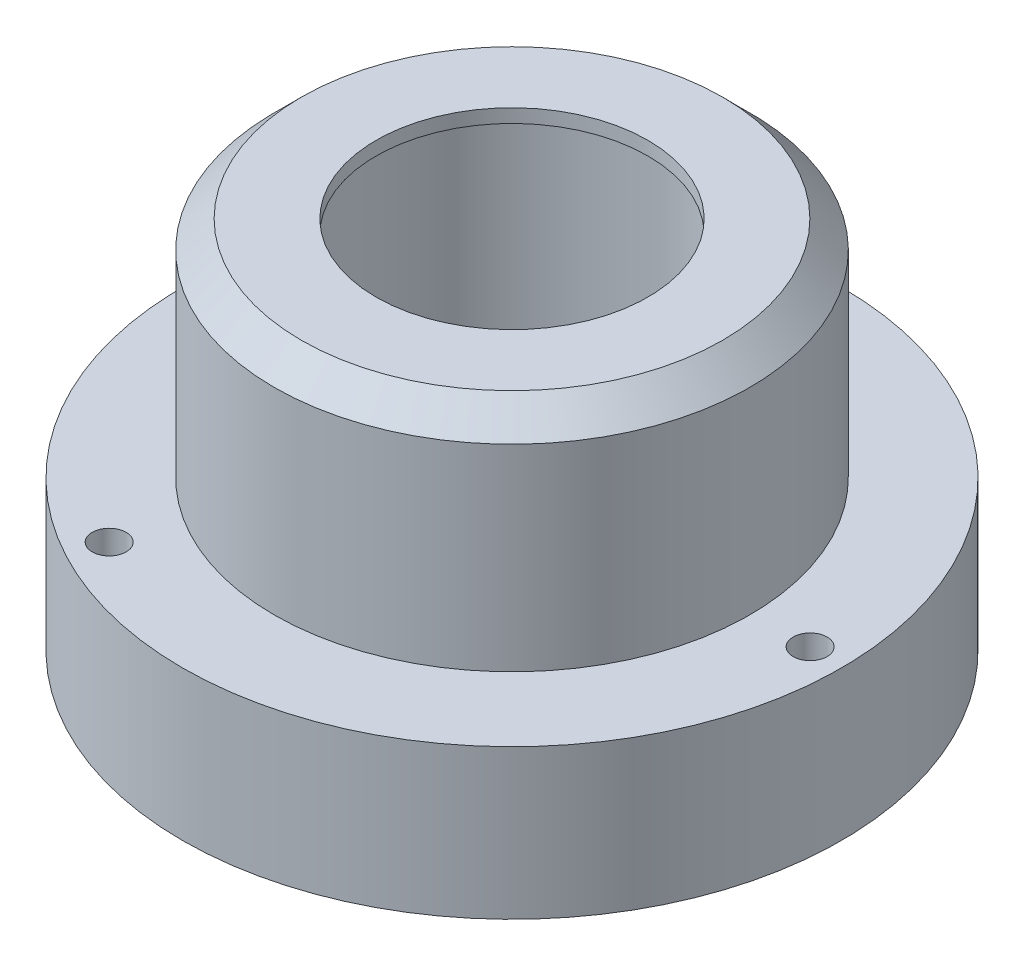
from build123d import *

# Parameters (mm, degrees)
R_P_TITION_CIRCULAIRE1_COUNT = 3


with BuildPart() as part:
    # Esquisse1 → R_volution1 (revolve)
    with BuildSketch(Plane.XY, mode=Mode.PRIVATE) as r_volution1_sk:
        Polygon((23.5, 0), (23.5, 53), (20, 53), (20, 55), (31, 55), (35, 51), (35, 22), (48.5, 22), (48.5, 0), align=None)
    revolve(r_volution1_sk.sketch.rotate(Axis((0, 45.247444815, 0), (0, -1, 0)), 90), axis=Axis((0, 45.247444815, 0), (0, -1, 0)))

    # Esquisse2 → Trou taraud_ M61 (revolve, cut)
    with BuildSketch(Plane(origin=(43.498358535, 22, -0.377895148), x_dir=(0, 0, 1), z_dir=(1, 0, 0))):
        Polygon((0, 0), (0, 18.443375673), (2.5, 17), (2.5, 0), align=None)
    trou_taraud_m61 = revolve(axis=Axis((43.498358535, 28.35, -0.377895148), (0, -1, 0)), mode=Mode.SUBTRACT)

    # Esquisse3 → Trou taraud_ M41 (revolve, cut)
    with BuildSketch(Plane(origin=(28, 0, 0), x_dir=(0, 0, -1), z_dir=(1, 0, 0))):
        Polygon((0, 0), (0, 12.452627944), (1.65, 11.5), (1.65, 0), align=None)
    trou_taraud_m41 = revolve(axis=Axis((28, -6.35, 0), (0, 1, 0)), mode=Mode.SUBTRACT)

    # Esquisse4 → Trou taraud_ M62 (revolve, cut)
    with BuildSketch(Plane(origin=(-43, 0, 0), x_dir=(0, 0, -1), z_dir=(1, 0, 0))):
        Polygon((0, 0), (0, 18.443375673), (2.5, 17), (2.5, 0), align=None)
    trou_taraud_m62 = revolve(axis=Axis((-43, -6.35, 0), (0, 1, 0)), mode=Mode.SUBTRACT)

    # R_p_tition circulaire1: Trou taraud_ M61, Trou taraud_ M41, Trou taraud_ M62 ×3 about axis
    r_p_tition_circulaire1_axis = Axis((0, 0, 0), (0, 1, 0))
    add([trou_taraud_m61.rotate(r_p_tition_circulaire1_axis, i * 360 / R_P_TITION_CIRCULAIRE1_COUNT) for i in range(1, R_P_TITION_CIRCULAIRE1_COUNT)], mode=Mode.SUBTRACT)
    add([trou_taraud_m41.rotate(r_p_tition_circulaire1_axis, i * 360 / R_P_TITION_CIRCULAIRE1_COUNT) for i in range(1, R_P_TITION_CIRCULAIRE1_COUNT)], mode=Mode.SUBTRACT)
    add([trou_taraud_m62.rotate(r_p_tition_circulaire1_axis, i * 360 / R_P_TITION_CIRCULAIRE1_COUNT) for i in range(1, R_P_TITION_CIRCULAIRE1_COUNT)], mode=Mode.SUBTRACT)


solid = part.part
